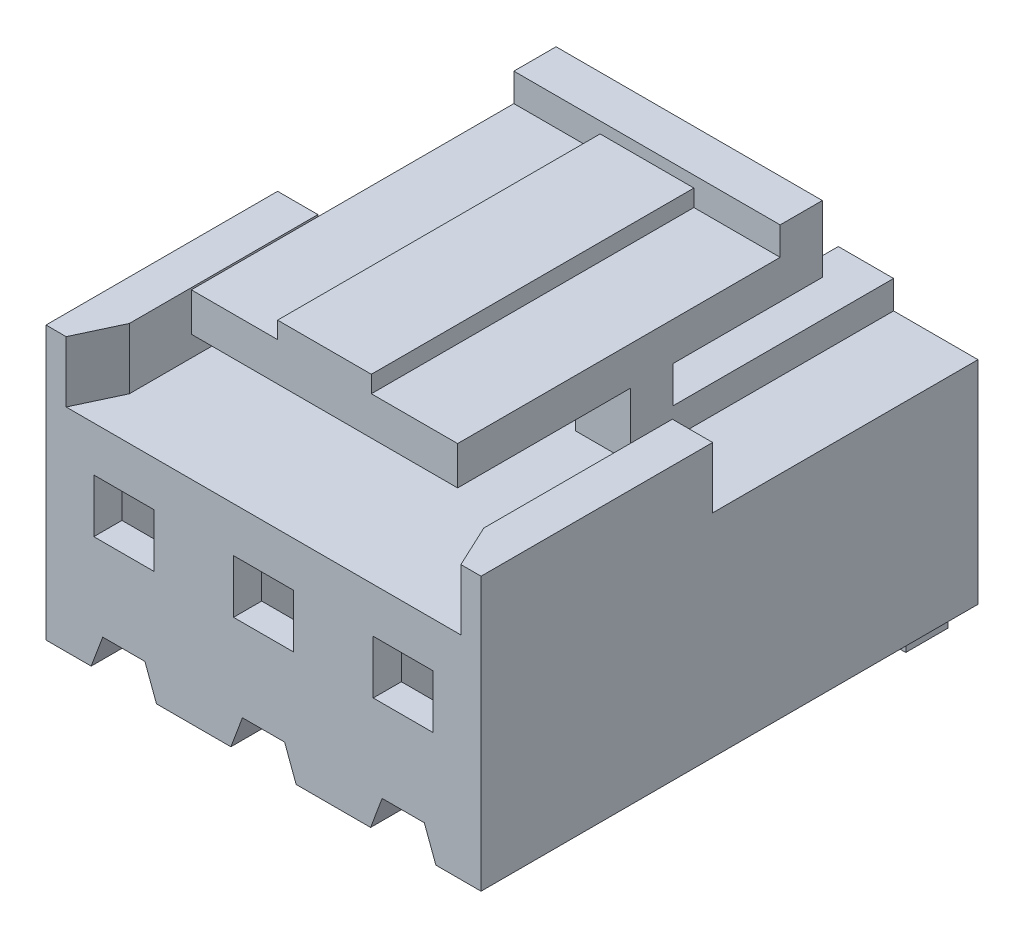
from build123d import *

# Parameters (mm, degrees)
SKETCH1_W       = 11.7856
SKETCH1_H       = 13.462
EXTRUDE1_DEPTH  = 5.7404
EXTRUDE2_DEPTH  = 1.651
SKETCH3_W       = 1.4986
SKETCH3_H       = 7.122662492
EXTRUDE3_DEPTH  = 0.762
SKETCH5_W       = 1.4986
SKETCH5_H       = 1.143
EXTRUDE5_DEPTH  = 0.9906
SKETCH6_W       = 7.2136
SKETCH6_H       = 9.8806
EXTRUDE6_DEPTH  = 1.0414
SKETCH7_W       = 2.54
SKETCH7_H       = 9.8806
EXTRUDE7_DEPTH  = 0.4572
SKETCH8_W       = 7.2136
SKETCH8_H       = 1.143
EXTRUDE8_DEPTH  = 0.762
SKETCH10_W      = 1.6256
SKETCH10_H      = 1.4478
EXTRUDE9_DEPTH  = 6.35
SKETCH12_W      = 3.2004
SKETCH12_H      = 4.2164
EXTRUDE10_DEPTH = 12.7
SKETCH13_W      = 10.16
SKETCH13_H      = 1.143
EXTRUDE11_DEPTH = 0.9652


with BuildPart() as part:
    # Sketch1 → Extrude1 (new body)
    with BuildSketch(Plane(origin=(0, 0, 0), x_dir=(1, 0, 0), z_dir=(0, 1, 0))):
        with Locations((5.8928, 6.731)):
            Rectangle(SKETCH1_W, SKETCH1_H)
    extrude(amount=EXTRUDE1_DEPTH)

    # Sketch2 → Extrude2 (add)
    with BuildSketch(Plane(origin=(0, 5.7404, 0), x_dir=(1, 0, 0), z_dir=(0, 1, 0))):
        Polygon((11.7856, 0), (11.7856, 6.2738), (10.6934, 6.2738), (10.6934, 1.166341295), (11.2395, 0), align=None)
        Polygon((0.5461, 0), (0, 0), (0, 6.2738), (1.0922, 6.2738), (1.0922, 1.166341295), align=None)
    extrude(amount=EXTRUDE2_DEPTH)

    # Sketch3 → Extrude3 (add)
    with BuildSketch(Plane(origin=(0, 5.7404, 0), x_dir=(1, 0, 0), z_dir=(0, 1, 0))):
        with Locations((3.0353, 9.900668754)):
            Rectangle(SKETCH3_W, SKETCH3_H)
        with Locations((8.7503, 9.900668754)):
            Rectangle(SKETCH3_W, SKETCH3_H)
    extrude(amount=EXTRUDE3_DEPTH)

    # Sketch5 → Extrude5 (add)
    with BuildSketch(Plane(origin=(0, 6.5024, 0), x_dir=(1, 0, 0), z_dir=(0, 1, 0))):
        with Locations((3.0353, 6.910837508)):
            Rectangle(SKETCH5_W, SKETCH5_H)
        with Locations((8.7503, 6.910837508)):
            Rectangle(SKETCH5_W, SKETCH5_H)
    extrude(amount=EXTRUDE5_DEPTH)

    # Sketch6 → Extrude6 (add)
    with BuildSketch(Plane(origin=(0, 7.493, 0), x_dir=(1, 0, 0), z_dir=(0, 1, 0))):
        with Locations((5.8928, 6.5913)):
            Rectangle(SKETCH6_W, SKETCH6_H)
    extrude(amount=EXTRUDE6_DEPTH)

    # Sketch7 → Extrude7 (add)
    with BuildSketch(Plane(origin=(0, 8.5344, 0), x_dir=(1, 0, 0), z_dir=(0, 1, 0))):
        with Locations((5.8928, 6.5913)):
            Rectangle(SKETCH7_W, SKETCH7_H)
    extrude(amount=EXTRUDE7_DEPTH)

    # Sketch8 → Extrude8 (add)
    with BuildSketch(Plane(origin=(0, 8.5344, 0), x_dir=(1, 0, 0), z_dir=(0, 1, 0))):
        with Locations((5.8928, 10.9601)):
            Rectangle(SKETCH8_W, SKETCH8_H)
    extrude(amount=EXTRUDE8_DEPTH)

    # Sketch10 → Extrude9 (cut)
    with BuildSketch(Plane.XY):
        with Locations((2.1082, 3.7973)):
            Rectangle(SKETCH10_W, SKETCH10_H)
        Polygon((5.3213, 0.8382), (6.4643, 0.8382), (6.777041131, 0), (5.008558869, 0), align=None)
        with Locations((5.8928, 3.7973)):
            Rectangle(SKETCH10_W, SKETCH10_H)
        with Locations((9.6774, 3.7973)):
            Rectangle(SKETCH10_W, SKETCH10_H)
        Polygon((10.561641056, 0), (8.793158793, 0), (9.105899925, 0.8382), (10.248899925, 0.8382), align=None)
        Polygon((1.536700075, 0.8382), (1.223958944, 0), (2.992441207, 0), (2.679700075, 0.8382), align=None)
    extrude(amount=-EXTRUDE9_DEPTH, mode=Mode.SUBTRACT)

    # Sketch12 → Extrude10 (cut)
    with BuildSketch(Plane(origin=(0, 0, -13.462), x_dir=(-1, 0, 0), z_dir=(0, 0, -1))):
        with Locations((-5.8928, 2.921)):
            Rectangle(SKETCH12_W, SKETCH12_H)
        with Locations((-9.652, 2.921)):
            Rectangle(SKETCH12_W, SKETCH12_H)
        with Locations((-2.1336, 2.921)):
            Rectangle(SKETCH12_W, SKETCH12_H)
    extrude(amount=-EXTRUDE10_DEPTH, mode=Mode.SUBTRACT)

    # Sketch13 → Extrude11 (add)
    with BuildSketch(Plane.XZ):
        with Locations((5.8928, -12.8905)):
            Rectangle(SKETCH13_W, SKETCH13_H)
    extrude(amount=EXTRUDE11_DEPTH)


solid = part.part
